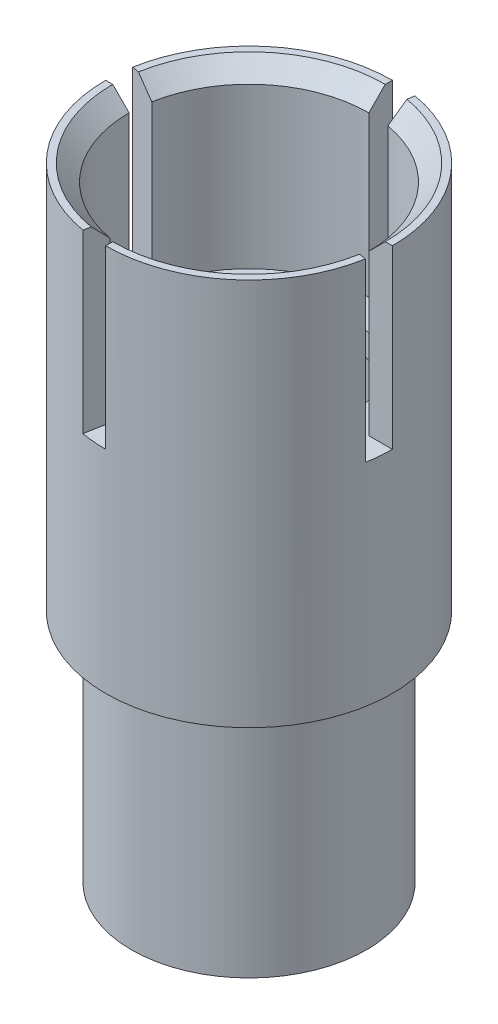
ISO-10303-21;
HEADER;
FILE_DESCRIPTION(('STEP AP214'),'2;1');
FILE_NAME('part.step','',(''),(''),'','','');
FILE_SCHEMA(('AUTOMOTIVE_DESIGN { 1 0 10303 214 1 1 1 1 }'));
ENDSEC;
DATA;
#1=APPLICATION_CONTEXT('core data for automotive mechanical design processes');
#2=APPLICATION_PROTOCOL_DEFINITION('international standard','automotive_design',2000,#1);
#3=PRODUCT_CONTEXT('',#1,'mechanical');
#4=PRODUCT('Part','Part','',(#3));
#5=PRODUCT_RELATED_PRODUCT_CATEGORY('part','',(#4));
#6=PRODUCT_DEFINITION_FORMATION('','',#4);
#7=PRODUCT_DEFINITION_CONTEXT('part definition',#1,'design');
#8=PRODUCT_DEFINITION('design','',#6,#7);
#9=PRODUCT_DEFINITION_SHAPE('','',#8);
#10=(LENGTH_UNIT() NAMED_UNIT(*) SI_UNIT(.MILLI.,.METRE.));
#11=(NAMED_UNIT(*) PLANE_ANGLE_UNIT() SI_UNIT($,.RADIAN.));
#12=(NAMED_UNIT(*) SI_UNIT($,.STERADIAN.) SOLID_ANGLE_UNIT());
#13=UNCERTAINTY_MEASURE_WITH_UNIT(LENGTH_MEASURE(1.E-05),#10,'distance_accuracy_value','');
#14=(GEOMETRIC_REPRESENTATION_CONTEXT(3) GLOBAL_UNCERTAINTY_ASSIGNED_CONTEXT((#13)) GLOBAL_UNIT_ASSIGNED_CONTEXT((#10,
#11,#12)) REPRESENTATION_CONTEXT('',''));
#15=CARTESIAN_POINT('',(0.,0.,0.));
#16=DIRECTION('',(0.,0.,1.));
#17=DIRECTION('',(1.,0.,0.));
#18=AXIS2_PLACEMENT_3D('',#15,#16,#17);
#19=CARTESIAN_POINT('',(0.,25.4,0.));
#20=DIRECTION('',(0.,-1.,0.));
#21=DIRECTION('',(0.,0.,-1.));
#22=AXIS2_PLACEMENT_3D('',#19,#20,#21);
#23=CYLINDRICAL_SURFACE('',#22,10.16);
#24=CARTESIAN_POINT('',(0.,0.,0.));
#25=DIRECTION('',(0.,-1.,0.));
#26=DIRECTION('',(0.,0.,-1.));
#27=AXIS2_PLACEMENT_3D('',#24,#25,#26);
#28=CIRCLE('',#27,10.16);
#29=CARTESIAN_POINT('',(0.,0.,-10.16));
#30=VERTEX_POINT('',#29);
#31=EDGE_CURVE('E204',#30,#30,#28,.T.);
#32=ORIENTED_EDGE('',*,*,#31,.T.);
#33=EDGE_LOOP('',(#32));
#34=FACE_BOUND('',#33,.T.);
#35=CARTESIAN_POINT('',(0.,27.94,0.));
#36=DIRECTION('',(0.,1.,0.));
#37=DIRECTION('',(0.,0.,1.));
#38=AXIS2_PLACEMENT_3D('',#35,#36,#37);
#39=CIRCLE('',#38,10.16);
#40=CARTESIAN_POINT('',(0.,27.94,10.16));
#41=VERTEX_POINT('',#40);
#42=EDGE_CURVE('E404',#41,#41,#39,.T.);
#43=ORIENTED_EDGE('',*,*,#42,.T.);
#44=EDGE_LOOP('',(#43));
#45=FACE_BOUND('',#44,.T.);
#46=ADVANCED_FACE('F37',(#34,#45),#23,.F.);
#47=CARTESIAN_POINT('',(0.,48.26,0.));
#48=DIRECTION('',(0.,1.,0.));
#49=DIRECTION('',(0.,0.,1.));
#50=AXIS2_PLACEMENT_3D('',#47,#48,#49);
#51=CIRCLE('',#50,10.16);
#52=CARTESIAN_POINT('',(0.,48.26,10.16));
#53=VERTEX_POINT('',#52);
#54=EDGE_CURVE('E220',#53,#53,#51,.T.);
#55=ORIENTED_EDGE('',*,*,#54,.T.);
#56=EDGE_LOOP('',(#55));
#57=FACE_BOUND('',#56,.T.);
#58=CARTESIAN_POINT('',(0.,45.72,0.));
#59=DIRECTION('',(0.,1.,0.));
#60=DIRECTION('',(0.,0.,1.));
#61=AXIS2_PLACEMENT_3D('',#58,#59,#60);
#62=CIRCLE('',#61,10.16);
#63=CARTESIAN_POINT('',(0.,45.72,10.16));
#64=VERTEX_POINT('',#63);
#65=EDGE_CURVE('E401',#64,#64,#62,.T.);
#66=ORIENTED_EDGE('',*,*,#65,.F.);
#67=EDGE_LOOP('',(#66));
#68=FACE_BOUND('',#67,.T.);
#69=ADVANCED_FACE('F424',(#57,#68),#23,.F.);
#70=CARTESIAN_POINT('',(0.,67.31,0.));
#71=DIRECTION('',(0.,1.,0.));
#72=DIRECTION('',(0.,0.,1.));
#73=AXIS2_PLACEMENT_3D('',#70,#71,#72);
#74=PLANE('',#73);
#75=CARTESIAN_POINT('',(0.,67.31,0.));
#76=DIRECTION('',(0.,1.,0.));
#77=DIRECTION('',(0.,0.,1.));
#78=AXIS2_PLACEMENT_3D('',#75,#76,#77);
#79=CIRCLE('',#78,14.732);
#80=CARTESIAN_POINT('',(2.55818495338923,67.31,-14.5081878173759));
#81=VERTEX_POINT('',#80);
#82=CARTESIAN_POINT('',(14.732,67.31,1.54309509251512E-13));
#83=VERTEX_POINT('',#82);
#84=EDGE_CURVE('E251',#81,#83,#79,.F.);
#85=ORIENTED_EDGE('',*,*,#84,.T.);
#86=DIRECTION('',(1.,0.,0.));
#87=VECTOR('',#86,1.);
#88=CARTESIAN_POINT('',(0.,67.31,0.));
#89=LINE('',#88,#87);
#90=CARTESIAN_POINT('',(15.494,67.31,1.62291035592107E-13));
#91=VERTEX_POINT('',#90);
#92=EDGE_CURVE('E52',#83,#91,#89,.T.);
#93=ORIENTED_EDGE('',*,*,#92,.T.);
#94=CARTESIAN_POINT('',(0.,67.31,0.));
#95=DIRECTION('',(0.,1.,0.));
#96=DIRECTION('',(0.,0.,1.));
#97=AXIS2_PLACEMENT_3D('',#94,#95,#96);
#98=CIRCLE('',#97,15.494);
#99=CARTESIAN_POINT('',(2.69050486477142,67.31,-15.2586113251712));
#100=VERTEX_POINT('',#99);
#101=EDGE_CURVE('E210',#91,#100,#98,.T.);
#102=ORIENTED_EDGE('',*,*,#101,.T.);
#103=DIRECTION('',(0.173648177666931,0.,-0.984807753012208));
#104=VECTOR('',#103,1.);
#105=CARTESIAN_POINT('',(0.,67.31,0.));
#106=LINE('',#105,#104);
#107=EDGE_CURVE('E257',#81,#100,#106,.T.);
#108=ORIENTED_EDGE('',*,*,#107,.F.);
#109=EDGE_LOOP('',(#85,#93,#102,#108));
#110=FACE_BOUND('',#109,.T.);
#111=ADVANCED_FACE('F254',(#110),#74,.T.);
#112=CARTESIAN_POINT('',(0.,48.26,0.));
#113=DIRECTION('',(0.,1.,0.));
#114=DIRECTION('',(0.,0.,1.));
#115=AXIS2_PLACEMENT_3D('',#112,#113,#114);
#116=CYLINDRICAL_SURFACE('',#115,12.954);
#117=DIRECTION('',(0.,1.,0.));
#118=VECTOR('',#117,1.);
#119=CARTESIAN_POINT('',(12.954,48.26,1.35685947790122E-13));
#120=LINE('',#119,#118);
#121=CARTESIAN_POINT('',(12.954,48.26,1.35685947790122E-13));
#122=VERTEX_POINT('',#121);
#123=CARTESIAN_POINT('',(12.954,65.532,1.35685947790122E-13));
#124=VERTEX_POINT('',#123);
#125=EDGE_CURVE('E184',#122,#124,#120,.T.);
#126=ORIENTED_EDGE('',*,*,#125,.T.);
#127=CARTESIAN_POINT('',(0.,65.532,0.));
#128=DIRECTION('',(0.,1.,0.));
#129=DIRECTION('',(0.,0.,1.));
#130=AXIS2_PLACEMENT_3D('',#127,#128,#129);
#131=CIRCLE('',#130,12.954);
#132=CARTESIAN_POINT('',(2.24943849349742,65.532,-12.7571996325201));
#133=VERTEX_POINT('',#132);
#134=EDGE_CURVE('E228',#124,#133,#131,.T.);
#135=ORIENTED_EDGE('',*,*,#134,.T.);
#136=DIRECTION('',(0.,1.,0.));
#137=VECTOR('',#136,1.);
#138=CARTESIAN_POINT('',(2.24943849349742,48.26,-12.7571996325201));
#139=LINE('',#138,#137);
#140=CARTESIAN_POINT('',(2.24943849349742,48.26,-12.7571996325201));
#141=VERTEX_POINT('',#140);
#142=EDGE_CURVE('E196',#141,#133,#139,.T.);
#143=ORIENTED_EDGE('',*,*,#142,.F.);
#144=CARTESIAN_POINT('',(0.,48.26,0.));
#145=DIRECTION('',(0.,1.,0.));
#146=DIRECTION('',(0.,0.,1.));
#147=AXIS2_PLACEMENT_3D('',#144,#145,#146);
#148=CIRCLE('',#147,12.954);
#149=EDGE_CURVE('E178',#122,#141,#148,.T.);
#150=ORIENTED_EDGE('',*,*,#149,.F.);
#151=EDGE_LOOP('',(#126,#135,#143,#150));
#152=FACE_BOUND('',#151,.T.);
#153=ADVANCED_FACE('F194',(#152),#116,.F.);
#154=CARTESIAN_POINT('',(0.,65.532,0.));
#155=DIRECTION('',(0.,1.,0.));
#156=DIRECTION('',(0.,0.,1.));
#157=AXIS2_PLACEMENT_3D('',#154,#155,#156);
#158=CONICAL_SURFACE('',#157,12.954,0.785398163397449);
#159=ORIENTED_EDGE('',*,*,#134,.F.);
#160=DIRECTION('',(0.707106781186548,0.707106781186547,0.));
#161=VECTOR('',#160,1.);
#162=CARTESIAN_POINT('',(0.,52.578,0.));
#163=LINE('',#162,#161);
#164=EDGE_CURVE('E45',#124,#83,#163,.T.);
#165=ORIENTED_EDGE('',*,*,#164,.T.);
#166=ORIENTED_EDGE('',*,*,#84,.F.);
#167=DIRECTION('',(0.122787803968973,0.707106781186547,-0.69636424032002));
#168=VECTOR('',#167,1.);
#169=CARTESIAN_POINT('',(0.,52.578,0.));
#170=LINE('',#169,#168);
#171=EDGE_CURVE('E245',#133,#81,#170,.T.);
#172=ORIENTED_EDGE('',*,*,#171,.F.);
#173=EDGE_LOOP('',(#159,#165,#166,#172));
#174=FACE_BOUND('',#173,.T.);
#175=ADVANCED_FACE('F249',(#174),#158,.F.);
#176=CARTESIAN_POINT('',(-14.5081878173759,67.31,-2.55818495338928));
#177=VERTEX_POINT('',#176);
#178=CARTESIAN_POINT('',(0.,67.31,-14.732));
#179=VERTEX_POINT('',#178);
#180=EDGE_CURVE('E233',#177,#179,#79,.F.);
#181=ORIENTED_EDGE('',*,*,#180,.T.);
#182=DIRECTION('',(0.,0.,-1.));
#183=VECTOR('',#182,1.);
#184=CARTESIAN_POINT('',(0.,67.31,0.));
#185=LINE('',#184,#183);
#186=CARTESIAN_POINT('',(0.,67.31,-15.494));
#187=VERTEX_POINT('',#186);
#188=EDGE_CURVE('E60',#179,#187,#185,.T.);
#189=ORIENTED_EDGE('',*,*,#188,.T.);
#190=CARTESIAN_POINT('',(-15.2586113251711,67.31,-2.69050486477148));
#191=VERTEX_POINT('',#190);
#192=EDGE_CURVE('E375',#187,#191,#98,.T.);
#193=ORIENTED_EDGE('',*,*,#192,.T.);
#194=DIRECTION('',(-0.984807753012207,0.,-0.173648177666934));
#195=VECTOR('',#194,1.);
#196=CARTESIAN_POINT('',(0.,67.31,0.));
#197=LINE('',#196,#195);
#198=EDGE_CURVE('E358',#177,#191,#197,.T.);
#199=ORIENTED_EDGE('',*,*,#198,.F.);
#200=EDGE_LOOP('',(#181,#189,#193,#199));
#201=FACE_BOUND('',#200,.T.);
#202=ADVANCED_FACE('F475',(#201),#74,.T.);
#203=DIRECTION('',(0.,1.,0.));
#204=VECTOR('',#203,1.);
#205=CARTESIAN_POINT('',(0.,48.26,-12.954));
#206=LINE('',#205,#204);
#207=CARTESIAN_POINT('',(0.,48.26,-12.954));
#208=VERTEX_POINT('',#207);
#209=CARTESIAN_POINT('',(0.,65.532,-12.954));
#210=VERTEX_POINT('',#209);
#211=EDGE_CURVE('E333',#208,#210,#206,.T.);
#212=ORIENTED_EDGE('',*,*,#211,.T.);
#213=CARTESIAN_POINT('',(-12.7571996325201,65.532,-2.24943849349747));
#214=VERTEX_POINT('',#213);
#215=EDGE_CURVE('E321',#210,#214,#131,.T.);
#216=ORIENTED_EDGE('',*,*,#215,.T.);
#217=DIRECTION('',(0.,1.,0.));
#218=VECTOR('',#217,1.);
#219=CARTESIAN_POINT('',(-12.7571996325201,48.26,-2.24943849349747));
#220=LINE('',#219,#218);
#221=CARTESIAN_POINT('',(-12.7571996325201,48.26,-2.24943849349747));
#222=VERTEX_POINT('',#221);
#223=EDGE_CURVE('E351',#222,#214,#220,.T.);
#224=ORIENTED_EDGE('',*,*,#223,.F.);
#225=EDGE_CURVE('E198',#208,#222,#148,.T.);
#226=ORIENTED_EDGE('',*,*,#225,.F.);
#227=EDGE_LOOP('',(#212,#216,#224,#226));
#228=FACE_BOUND('',#227,.T.);
#229=ADVANCED_FACE('F467',(#228),#116,.F.);
#230=ORIENTED_EDGE('',*,*,#215,.F.);
#231=DIRECTION('',(0.,0.707106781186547,-0.707106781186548));
#232=VECTOR('',#231,1.);
#233=CARTESIAN_POINT('',(0.,52.578,0.));
#234=LINE('',#233,#232);
#235=EDGE_CURVE('E243',#210,#179,#234,.T.);
#236=ORIENTED_EDGE('',*,*,#235,.T.);
#237=ORIENTED_EDGE('',*,*,#180,.F.);
#238=DIRECTION('',(-0.696364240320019,0.707106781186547,-0.122787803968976));
#239=VECTOR('',#238,1.);
#240=CARTESIAN_POINT('',(0.,52.578,0.));
#241=LINE('',#240,#239);
#242=EDGE_CURVE('E241',#214,#177,#241,.T.);
#243=ORIENTED_EDGE('',*,*,#242,.F.);
#244=EDGE_LOOP('',(#230,#236,#237,#243));
#245=FACE_BOUND('',#244,.T.);
#246=ADVANCED_FACE('F457',(#245),#158,.F.);
#247=CARTESIAN_POINT('',(-2.55818495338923,67.31,14.5081878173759));
#248=VERTEX_POINT('',#247);
#249=CARTESIAN_POINT('',(-14.732,67.31,0.));
#250=VERTEX_POINT('',#249);
#251=EDGE_CURVE('E229',#248,#250,#79,.F.);
#252=ORIENTED_EDGE('',*,*,#251,.T.);
#253=DIRECTION('',(-1.,0.,0.));
#254=VECTOR('',#253,1.);
#255=CARTESIAN_POINT('',(0.,67.31,0.));
#256=LINE('',#255,#254);
#257=CARTESIAN_POINT('',(-15.494,67.31,0.));
#258=VERTEX_POINT('',#257);
#259=EDGE_CURVE('E353',#250,#258,#256,.T.);
#260=ORIENTED_EDGE('',*,*,#259,.T.);
#261=CARTESIAN_POINT('',(-2.69050486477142,67.31,15.2586113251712));
#262=VERTEX_POINT('',#261);
#263=EDGE_CURVE('E211',#258,#262,#98,.T.);
#264=ORIENTED_EDGE('',*,*,#263,.T.);
#265=DIRECTION('',(-0.173648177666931,0.,0.984807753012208));
#266=VECTOR('',#265,1.);
#267=CARTESIAN_POINT('',(0.,67.31,0.));
#268=LINE('',#267,#266);
#269=EDGE_CURVE('E298',#248,#262,#268,.T.);
#270=ORIENTED_EDGE('',*,*,#269,.F.);
#271=EDGE_LOOP('',(#252,#260,#264,#270));
#272=FACE_BOUND('',#271,.T.);
#273=ADVANCED_FACE('F374',(#272),#74,.T.);
#274=DIRECTION('',(0.,1.,0.));
#275=VECTOR('',#274,1.);
#276=CARTESIAN_POINT('',(-12.954,48.26,0.));
#277=LINE('',#276,#275);
#278=CARTESIAN_POINT('',(-12.954,48.26,0.));
#279=VERTEX_POINT('',#278);
#280=CARTESIAN_POINT('',(-12.954,65.532,0.));
#281=VERTEX_POINT('',#280);
#282=EDGE_CURVE('E319',#279,#281,#277,.T.);
#283=ORIENTED_EDGE('',*,*,#282,.T.);
#284=CARTESIAN_POINT('',(-2.24943849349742,65.532,12.7571996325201));
#285=VERTEX_POINT('',#284);
#286=EDGE_CURVE('E217',#281,#285,#131,.T.);
#287=ORIENTED_EDGE('',*,*,#286,.T.);
#288=DIRECTION('',(0.,1.,0.));
#289=VECTOR('',#288,1.);
#290=CARTESIAN_POINT('',(-2.24943849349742,48.26,12.7571996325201));
#291=LINE('',#290,#289);
#292=CARTESIAN_POINT('',(-2.24943849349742,48.26,12.7571996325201));
#293=VERTEX_POINT('',#292);
#294=EDGE_CURVE('E277',#293,#285,#291,.T.);
#295=ORIENTED_EDGE('',*,*,#294,.F.);
#296=EDGE_CURVE('E201',#279,#293,#148,.T.);
#297=ORIENTED_EDGE('',*,*,#296,.F.);
#298=EDGE_LOOP('',(#283,#287,#295,#297));
#299=FACE_BOUND('',#298,.T.);
#300=ADVANCED_FACE('F316',(#299),#116,.F.);
#301=ORIENTED_EDGE('',*,*,#286,.F.);
#302=DIRECTION('',(-0.707106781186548,0.707106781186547,0.));
#303=VECTOR('',#302,1.);
#304=CARTESIAN_POINT('',(0.,52.578,0.));
#305=LINE('',#304,#303);
#306=EDGE_CURVE('E238',#281,#250,#305,.T.);
#307=ORIENTED_EDGE('',*,*,#306,.T.);
#308=ORIENTED_EDGE('',*,*,#251,.F.);
#309=DIRECTION('',(-0.122787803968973,0.707106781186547,0.69636424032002));
#310=VECTOR('',#309,1.);
#311=CARTESIAN_POINT('',(0.,52.578,0.));
#312=LINE('',#311,#310);
#313=EDGE_CURVE('E236',#285,#248,#312,.T.);
#314=ORIENTED_EDGE('',*,*,#313,.F.);
#315=EDGE_LOOP('',(#301,#307,#308,#314));
#316=FACE_BOUND('',#315,.T.);
#317=ADVANCED_FACE('F371',(#316),#158,.F.);
#318=CARTESIAN_POINT('',(0.,25.4,0.));
#319=DIRECTION('',(0.,-1.,0.));
#320=DIRECTION('',(0.,0.,-1.));
#321=AXIS2_PLACEMENT_3D('',#318,#319,#320);
#322=CYLINDRICAL_SURFACE('',#321,12.7);
#323=CARTESIAN_POINT('',(0.,25.4,0.));
#324=DIRECTION('',(0.,1.,0.));
#325=DIRECTION('',(0.,0.,1.));
#326=AXIS2_PLACEMENT_3D('',#323,#324,#325);
#327=CIRCLE('',#326,12.7);
#328=CARTESIAN_POINT('',(0.,25.4,12.7));
#329=VERTEX_POINT('',#328);
#330=EDGE_CURVE('E214',#329,#329,#327,.T.);
#331=ORIENTED_EDGE('',*,*,#330,.F.);
#332=EDGE_LOOP('',(#331));
#333=FACE_BOUND('',#332,.T.);
#334=CARTESIAN_POINT('',(0.,0.,0.));
#335=DIRECTION('',(0.,1.,0.));
#336=DIRECTION('',(0.,0.,1.));
#337=AXIS2_PLACEMENT_3D('',#334,#335,#336);
#338=CIRCLE('',#337,12.7);
#339=CARTESIAN_POINT('',(0.,0.,12.7));
#340=VERTEX_POINT('',#339);
#341=EDGE_CURVE('E209',#340,#340,#338,.T.);
#342=ORIENTED_EDGE('',*,*,#341,.T.);
#343=EDGE_LOOP('',(#342));
#344=FACE_BOUND('',#343,.T.);
#345=ADVANCED_FACE('F450',(#333,#344),#322,.T.);
#346=CARTESIAN_POINT('',(0.,0.,0.));
#347=DIRECTION('',(0.,1.,0.));
#348=DIRECTION('',(0.,0.,1.));
#349=AXIS2_PLACEMENT_3D('',#346,#347,#348);
#350=PLANE('',#349);
#351=ORIENTED_EDGE('',*,*,#31,.F.);
#352=EDGE_LOOP('',(#351));
#353=FACE_BOUND('',#352,.T.);
#354=ORIENTED_EDGE('',*,*,#341,.F.);
#355=EDGE_LOOP('',(#354));
#356=FACE_BOUND('',#355,.T.);
#357=ADVANCED_FACE('F448',(#353,#356),#350,.F.);
#358=CARTESIAN_POINT('',(0.,67.31,0.));
#359=DIRECTION('',(0.,-1.,0.));
#360=DIRECTION('',(0.,0.,-1.));
#361=AXIS2_PLACEMENT_3D('',#358,#359,#360);
#362=CYLINDRICAL_SURFACE('',#361,15.494);
#363=CARTESIAN_POINT('',(0.,48.26,0.));
#364=DIRECTION('',(0.,-1.,0.));
#365=DIRECTION('',(0.,0.,-1.));
#366=AXIS2_PLACEMENT_3D('',#363,#364,#365);
#367=CIRCLE('',#366,15.494);
#368=CARTESIAN_POINT('',(15.494,48.26,1.62291035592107E-13));
#369=VERTEX_POINT('',#368);
#370=CARTESIAN_POINT('',(15.2586113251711,48.26,2.69050486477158));
#371=VERTEX_POINT('',#370);
#372=EDGE_CURVE('E182',#369,#371,#367,.T.);
#373=ORIENTED_EDGE('',*,*,#372,.T.);
#374=DIRECTION('',(0.,-1.,0.));
#375=VECTOR('',#374,1.);
#376=CARTESIAN_POINT('',(15.2586113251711,67.31,2.69050486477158));
#377=LINE('',#376,#375);
#378=CARTESIAN_POINT('',(15.2586113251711,67.31,2.69050486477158));
#379=VERTEX_POINT('',#378);
#380=EDGE_CURVE('E385',#371,#379,#377,.F.);
#381=ORIENTED_EDGE('',*,*,#380,.T.);
#382=CARTESIAN_POINT('',(0.,67.31,15.494));
#383=VERTEX_POINT('',#382);
#384=EDGE_CURVE('E206',#383,#379,#98,.T.);
#385=ORIENTED_EDGE('',*,*,#384,.F.);
#386=DIRECTION('',(0.,-1.,0.));
#387=VECTOR('',#386,1.);
#388=CARTESIAN_POINT('',(0.,67.31,15.494));
#389=LINE('',#388,#387);
#390=CARTESIAN_POINT('',(0.,48.26,15.494));
#391=VERTEX_POINT('',#390);
#392=EDGE_CURVE('E276',#391,#383,#389,.F.);
#393=ORIENTED_EDGE('',*,*,#392,.F.);
#394=CARTESIAN_POINT('',(0.,48.26,0.));
#395=DIRECTION('',(0.,-1.,0.));
#396=DIRECTION('',(0.,0.,-1.));
#397=AXIS2_PLACEMENT_3D('',#394,#395,#396);
#398=CIRCLE('',#397,15.494);
#399=CARTESIAN_POINT('',(-2.69050486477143,48.26,15.2586113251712));
#400=VERTEX_POINT('',#399);
#401=EDGE_CURVE('E223',#391,#400,#398,.T.);
#402=ORIENTED_EDGE('',*,*,#401,.T.);
#403=DIRECTION('',(0.,-1.,0.));
#404=VECTOR('',#403,1.);
#405=CARTESIAN_POINT('',(-2.69050486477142,67.31,15.2586113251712));
#406=LINE('',#405,#404);
#407=EDGE_CURVE('E301',#400,#262,#406,.F.);
#408=ORIENTED_EDGE('',*,*,#407,.T.);
#409=ORIENTED_EDGE('',*,*,#263,.F.);
#410=DIRECTION('',(0.,-1.,0.));
#411=VECTOR('',#410,1.);
#412=CARTESIAN_POINT('',(-15.494,67.31,0.));
#413=LINE('',#412,#411);
#414=CARTESIAN_POINT('',(-15.494,48.26,0.));
#415=VERTEX_POINT('',#414);
#416=EDGE_CURVE('E356',#415,#258,#413,.F.);
#417=ORIENTED_EDGE('',*,*,#416,.F.);
#418=CARTESIAN_POINT('',(0.,48.26,0.));
#419=DIRECTION('',(0.,-1.,0.));
#420=DIRECTION('',(0.,0.,-1.));
#421=AXIS2_PLACEMENT_3D('',#418,#419,#420);
#422=CIRCLE('',#421,15.494);
#423=CARTESIAN_POINT('',(-15.2586113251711,48.26,-2.69050486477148));
#424=VERTEX_POINT('',#423);
#425=EDGE_CURVE('E291',#415,#424,#422,.T.);
#426=ORIENTED_EDGE('',*,*,#425,.T.);
#427=DIRECTION('',(0.,-1.,0.));
#428=VECTOR('',#427,1.);
#429=CARTESIAN_POINT('',(-15.2586113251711,67.31,-2.69050486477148));
#430=LINE('',#429,#428);
#431=EDGE_CURVE('E361',#424,#191,#430,.F.);
#432=ORIENTED_EDGE('',*,*,#431,.T.);
#433=ORIENTED_EDGE('',*,*,#192,.F.);
#434=DIRECTION('',(0.,-1.,0.));
#435=VECTOR('',#434,1.);
#436=CARTESIAN_POINT('',(0.,67.31,-15.494));
#437=LINE('',#436,#435);
#438=CARTESIAN_POINT('',(0.,48.26,-15.494));
#439=VERTEX_POINT('',#438);
#440=EDGE_CURVE('E331',#439,#187,#437,.F.);
#441=ORIENTED_EDGE('',*,*,#440,.F.);
#442=CARTESIAN_POINT('',(0.,48.26,0.));
#443=DIRECTION('',(0.,-1.,0.));
#444=DIRECTION('',(0.,0.,-1.));
#445=AXIS2_PLACEMENT_3D('',#442,#443,#444);
#446=CIRCLE('',#445,15.494);
#447=CARTESIAN_POINT('',(2.69050486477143,48.26,-15.2586113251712));
#448=VERTEX_POINT('',#447);
#449=EDGE_CURVE('E342',#439,#448,#446,.T.);
#450=ORIENTED_EDGE('',*,*,#449,.T.);
#451=DIRECTION('',(0.,-1.,0.));
#452=VECTOR('',#451,1.);
#453=CARTESIAN_POINT('',(2.69050486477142,67.31,-15.2586113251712));
#454=LINE('',#453,#452);
#455=EDGE_CURVE('E339',#448,#100,#454,.F.);
#456=ORIENTED_EDGE('',*,*,#455,.T.);
#457=ORIENTED_EDGE('',*,*,#101,.F.);
#458=DIRECTION('',(0.,-1.,0.));
#459=VECTOR('',#458,1.);
#460=CARTESIAN_POINT('',(15.494,67.31,1.62291035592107E-13));
#461=LINE('',#460,#459);
#462=EDGE_CURVE('E391',#369,#91,#461,.F.);
#463=ORIENTED_EDGE('',*,*,#462,.F.);
#464=EDGE_LOOP('',(#373,#381,#385,#393,#402,#408,#409,#417,#426,#432,#433,#441,#450,#456,#457,#463));
#465=FACE_BOUND('',#464,.T.);
#466=CARTESIAN_POINT('',(0.,25.4,0.));
#467=DIRECTION('',(0.,1.,0.));
#468=DIRECTION('',(0.,0.,1.));
#469=AXIS2_PLACEMENT_3D('',#466,#467,#468);
#470=CIRCLE('',#469,15.494);
#471=CARTESIAN_POINT('',(0.,25.4,15.494));
#472=VERTEX_POINT('',#471);
#473=EDGE_CURVE('E200',#472,#472,#470,.T.);
#474=ORIENTED_EDGE('',*,*,#473,.T.);
#475=EDGE_LOOP('',(#474));
#476=FACE_BOUND('',#475,.T.);
#477=ADVANCED_FACE('F305',(#465,#476),#362,.T.);
#478=DIRECTION('',(0.984807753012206,0.,0.173648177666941));
#479=VECTOR('',#478,1.);
#480=CARTESIAN_POINT('',(0.,67.31,0.));
#481=LINE('',#480,#479);
#482=CARTESIAN_POINT('',(14.5081878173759,67.31,2.55818495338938));
#483=VERTEX_POINT('',#482);
#484=EDGE_CURVE('E267',#483,#379,#481,.T.);
#485=ORIENTED_EDGE('',*,*,#484,.F.);
#486=CARTESIAN_POINT('',(0.,67.31,14.732));
#487=VERTEX_POINT('',#486);
#488=EDGE_CURVE('E227',#483,#487,#79,.F.);
#489=ORIENTED_EDGE('',*,*,#488,.T.);
#490=DIRECTION('',(0.,0.,1.));
#491=VECTOR('',#490,1.);
#492=CARTESIAN_POINT('',(0.,67.31,0.));
#493=LINE('',#492,#491);
#494=EDGE_CURVE('E265',#487,#383,#493,.T.);
#495=ORIENTED_EDGE('',*,*,#494,.T.);
#496=ORIENTED_EDGE('',*,*,#384,.T.);
#497=EDGE_LOOP('',(#485,#489,#495,#496));
#498=FACE_BOUND('',#497,.T.);
#499=ADVANCED_FACE('F264',(#498),#74,.T.);
#500=CARTESIAN_POINT('',(0.,25.4,0.));
#501=DIRECTION('',(0.,1.,0.));
#502=DIRECTION('',(0.,0.,1.));
#503=AXIS2_PLACEMENT_3D('',#500,#501,#502);
#504=PLANE('',#503);
#505=ORIENTED_EDGE('',*,*,#330,.T.);
#506=EDGE_LOOP('',(#505));
#507=FACE_BOUND('',#506,.T.);
#508=ORIENTED_EDGE('',*,*,#473,.F.);
#509=EDGE_LOOP('',(#508));
#510=FACE_BOUND('',#509,.T.);
#511=ADVANCED_FACE('F440',(#507,#510),#504,.F.);
#512=CARTESIAN_POINT('',(0.,65.532,12.954));
#513=VERTEX_POINT('',#512);
#514=CARTESIAN_POINT('',(12.7571996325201,65.532,2.24943849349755));
#515=VERTEX_POINT('',#514);
#516=EDGE_CURVE('E224',#513,#515,#131,.T.);
#517=ORIENTED_EDGE('',*,*,#516,.T.);
#518=DIRECTION('',(0.,1.,0.));
#519=VECTOR('',#518,1.);
#520=CARTESIAN_POINT('',(12.7571996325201,48.26,2.24943849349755));
#521=LINE('',#520,#519);
#522=CARTESIAN_POINT('',(12.7571996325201,48.26,2.24943849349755));
#523=VERTEX_POINT('',#522);
#524=EDGE_CURVE('E284',#523,#515,#521,.T.);
#525=ORIENTED_EDGE('',*,*,#524,.F.);
#526=CARTESIAN_POINT('',(0.,48.26,12.954));
#527=VERTEX_POINT('',#526);
#528=EDGE_CURVE('E197',#527,#523,#148,.T.);
#529=ORIENTED_EDGE('',*,*,#528,.F.);
#530=DIRECTION('',(0.,1.,0.));
#531=VECTOR('',#530,1.);
#532=CARTESIAN_POINT('',(0.,48.26,12.954));
#533=LINE('',#532,#531);
#534=EDGE_CURVE('E285',#527,#513,#533,.T.);
#535=ORIENTED_EDGE('',*,*,#534,.T.);
#536=EDGE_LOOP('',(#517,#525,#529,#535));
#537=FACE_BOUND('',#536,.T.);
#538=ADVANCED_FACE('F282',(#537),#116,.F.);
#539=CARTESIAN_POINT('',(0.,48.26,0.));
#540=DIRECTION('',(0.,1.,0.));
#541=DIRECTION('',(0.,0.,1.));
#542=AXIS2_PLACEMENT_3D('',#539,#540,#541);
#543=PLANE('',#542);
#544=ORIENTED_EDGE('',*,*,#54,.F.);
#545=EDGE_LOOP('',(#544));
#546=FACE_BOUND('',#545,.T.);
#547=ORIENTED_EDGE('',*,*,#528,.T.);
#548=DIRECTION('',(-0.984807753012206,0.,-0.173648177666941));
#549=VECTOR('',#548,1.);
#550=CARTESIAN_POINT('',(12.7571996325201,48.26,2.24943849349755));
#551=LINE('',#550,#549);
#552=EDGE_CURVE('E191',#371,#523,#551,.T.);
#553=ORIENTED_EDGE('',*,*,#552,.F.);
#554=ORIENTED_EDGE('',*,*,#372,.F.);
#555=DIRECTION('',(-1.,0.,0.));
#556=VECTOR('',#555,1.);
#557=CARTESIAN_POINT('',(12.954,48.26,1.35685947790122E-13));
#558=LINE('',#557,#556);
#559=EDGE_CURVE('E172',#369,#122,#558,.T.);
#560=ORIENTED_EDGE('',*,*,#559,.T.);
#561=ORIENTED_EDGE('',*,*,#149,.T.);
#562=DIRECTION('',(-0.173648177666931,0.,0.984807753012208));
#563=VECTOR('',#562,1.);
#564=CARTESIAN_POINT('',(2.24943849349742,48.26,-12.7571996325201));
#565=LINE('',#564,#563);
#566=EDGE_CURVE('E329',#448,#141,#565,.T.);
#567=ORIENTED_EDGE('',*,*,#566,.F.);
#568=ORIENTED_EDGE('',*,*,#449,.F.);
#569=DIRECTION('',(0.,0.,1.));
#570=VECTOR('',#569,1.);
#571=CARTESIAN_POINT('',(0.,48.26,-12.954));
#572=LINE('',#571,#570);
#573=EDGE_CURVE('E380',#439,#208,#572,.T.);
#574=ORIENTED_EDGE('',*,*,#573,.T.);
#575=ORIENTED_EDGE('',*,*,#225,.T.);
#576=DIRECTION('',(0.984807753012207,0.,0.173648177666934));
#577=VECTOR('',#576,1.);
#578=CARTESIAN_POINT('',(-12.7571996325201,48.26,-2.24943849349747));
#579=LINE('',#578,#577);
#580=EDGE_CURVE('E348',#424,#222,#579,.T.);
#581=ORIENTED_EDGE('',*,*,#580,.F.);
#582=ORIENTED_EDGE('',*,*,#425,.F.);
#583=DIRECTION('',(1.,0.,0.));
#584=VECTOR('',#583,1.);
#585=CARTESIAN_POINT('',(-12.954,48.26,0.));
#586=LINE('',#585,#584);
#587=EDGE_CURVE('E345',#415,#279,#586,.T.);
#588=ORIENTED_EDGE('',*,*,#587,.T.);
#589=ORIENTED_EDGE('',*,*,#296,.T.);
#590=DIRECTION('',(0.173648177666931,0.,-0.984807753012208));
#591=VECTOR('',#590,1.);
#592=CARTESIAN_POINT('',(-2.24943849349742,48.26,12.7571996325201));
#593=LINE('',#592,#591);
#594=EDGE_CURVE('E286',#400,#293,#593,.T.);
#595=ORIENTED_EDGE('',*,*,#594,.F.);
#596=ORIENTED_EDGE('',*,*,#401,.F.);
#597=DIRECTION('',(0.,0.,-1.));
#598=VECTOR('',#597,1.);
#599=CARTESIAN_POINT('',(0.,48.26,12.954));
#600=LINE('',#599,#598);
#601=EDGE_CURVE('E287',#391,#527,#600,.T.);
#602=ORIENTED_EDGE('',*,*,#601,.T.);
#603=EDGE_LOOP('',(#547,#553,#554,#560,#561,#567,#568,#574,#575,#581,#582,#588,#589,#595,#596,#602));
#604=FACE_BOUND('',#603,.T.);
#605=ADVANCED_FACE('F175',(#546,#604),#543,.T.);
#606=DIRECTION('',(0.696364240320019,0.707106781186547,0.122787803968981));
#607=VECTOR('',#606,1.);
#608=CARTESIAN_POINT('',(0.,52.578,0.));
#609=LINE('',#608,#607);
#610=EDGE_CURVE('E11',#515,#483,#609,.T.);
#611=ORIENTED_EDGE('',*,*,#610,.F.);
#612=ORIENTED_EDGE('',*,*,#516,.F.);
#613=DIRECTION('',(0.,0.707106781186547,0.707106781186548));
#614=VECTOR('',#613,1.);
#615=CARTESIAN_POINT('',(0.,52.578,0.));
#616=LINE('',#615,#614);
#617=EDGE_CURVE('E232',#513,#487,#616,.T.);
#618=ORIENTED_EDGE('',*,*,#617,.T.);
#619=ORIENTED_EDGE('',*,*,#488,.F.);
#620=EDGE_LOOP('',(#611,#612,#618,#619));
#621=FACE_BOUND('',#620,.T.);
#622=ADVANCED_FACE('F39',(#621),#158,.F.);
#623=CARTESIAN_POINT('',(0.,0.,0.));
#624=DIRECTION('',(-0.984807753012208,0.,-0.173648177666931));
#625=DIRECTION('',(-0.173648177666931,0.,0.984807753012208));
#626=AXIS2_PLACEMENT_3D('',#623,#624,#625);
#627=PLANE('',#626);
#628=ORIENTED_EDGE('',*,*,#594,.T.);
#629=ORIENTED_EDGE('',*,*,#294,.T.);
#630=ORIENTED_EDGE('',*,*,#313,.T.);
#631=ORIENTED_EDGE('',*,*,#269,.T.);
#632=ORIENTED_EDGE('',*,*,#407,.F.);
#633=EDGE_LOOP('',(#628,#629,#630,#631,#632));
#634=FACE_BOUND('',#633,.T.);
#635=ADVANCED_FACE('F312',(#634),#627,.F.);
#636=CARTESIAN_POINT('',(0.,0.,0.));
#637=DIRECTION('',(-1.,0.,0.));
#638=DIRECTION('',(0.,0.,1.));
#639=AXIS2_PLACEMENT_3D('',#636,#637,#638);
#640=PLANE('',#639);
#641=ORIENTED_EDGE('',*,*,#392,.T.);
#642=ORIENTED_EDGE('',*,*,#494,.F.);
#643=ORIENTED_EDGE('',*,*,#617,.F.);
#644=ORIENTED_EDGE('',*,*,#534,.F.);
#645=ORIENTED_EDGE('',*,*,#601,.F.);
#646=EDGE_LOOP('',(#641,#642,#643,#644,#645));
#647=FACE_BOUND('',#646,.T.);
#648=ADVANCED_FACE('F271',(#647),#640,.T.);
#649=CARTESIAN_POINT('',(0.,0.,0.));
#650=DIRECTION('',(0.173648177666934,0.,-0.984807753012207));
#651=DIRECTION('',(-0.984807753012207,0.,-0.173648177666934));
#652=AXIS2_PLACEMENT_3D('',#649,#650,#651);
#653=PLANE('',#652);
#654=ORIENTED_EDGE('',*,*,#580,.T.);
#655=ORIENTED_EDGE('',*,*,#223,.T.);
#656=ORIENTED_EDGE('',*,*,#242,.T.);
#657=ORIENTED_EDGE('',*,*,#198,.T.);
#658=ORIENTED_EDGE('',*,*,#431,.F.);
#659=EDGE_LOOP('',(#654,#655,#656,#657,#658));
#660=FACE_BOUND('',#659,.T.);
#661=ADVANCED_FACE('F564',(#660),#653,.F.);
#662=CARTESIAN_POINT('',(0.,0.,0.));
#663=DIRECTION('',(0.,0.,-1.));
#664=DIRECTION('',(-1.,0.,0.));
#665=AXIS2_PLACEMENT_3D('',#662,#663,#664);
#666=PLANE('',#665);
#667=ORIENTED_EDGE('',*,*,#416,.T.);
#668=ORIENTED_EDGE('',*,*,#259,.F.);
#669=ORIENTED_EDGE('',*,*,#306,.F.);
#670=ORIENTED_EDGE('',*,*,#282,.F.);
#671=ORIENTED_EDGE('',*,*,#587,.F.);
#672=EDGE_LOOP('',(#667,#668,#669,#670,#671));
#673=FACE_BOUND('',#672,.T.);
#674=ADVANCED_FACE('F369',(#673),#666,.T.);
#675=CARTESIAN_POINT('',(0.,0.,0.));
#676=DIRECTION('',(0.984807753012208,0.,0.173648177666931));
#677=DIRECTION('',(0.173648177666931,0.,-0.984807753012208));
#678=AXIS2_PLACEMENT_3D('',#675,#676,#677);
#679=PLANE('',#678);
#680=ORIENTED_EDGE('',*,*,#566,.T.);
#681=ORIENTED_EDGE('',*,*,#142,.T.);
#682=ORIENTED_EDGE('',*,*,#171,.T.);
#683=ORIENTED_EDGE('',*,*,#107,.T.);
#684=ORIENTED_EDGE('',*,*,#455,.F.);
#685=EDGE_LOOP('',(#680,#681,#682,#683,#684));
#686=FACE_BOUND('',#685,.T.);
#687=ADVANCED_FACE('F328',(#686),#679,.F.);
#688=CARTESIAN_POINT('',(0.,0.,0.));
#689=DIRECTION('',(1.,0.,0.));
#690=DIRECTION('',(0.,0.,-1.));
#691=AXIS2_PLACEMENT_3D('',#688,#689,#690);
#692=PLANE('',#691);
#693=ORIENTED_EDGE('',*,*,#440,.T.);
#694=ORIENTED_EDGE('',*,*,#188,.F.);
#695=ORIENTED_EDGE('',*,*,#235,.F.);
#696=ORIENTED_EDGE('',*,*,#211,.F.);
#697=ORIENTED_EDGE('',*,*,#573,.F.);
#698=EDGE_LOOP('',(#693,#694,#695,#696,#697));
#699=FACE_BOUND('',#698,.T.);
#700=ADVANCED_FACE('F382',(#699),#692,.T.);
#701=CARTESIAN_POINT('',(0.,0.,0.));
#702=DIRECTION('',(-0.173648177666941,0.,0.984807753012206));
#703=DIRECTION('',(0.984807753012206,0.,0.173648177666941));
#704=AXIS2_PLACEMENT_3D('',#701,#702,#703);
#705=PLANE('',#704);
#706=ORIENTED_EDGE('',*,*,#552,.T.);
#707=ORIENTED_EDGE('',*,*,#524,.T.);
#708=ORIENTED_EDGE('',*,*,#610,.T.);
#709=ORIENTED_EDGE('',*,*,#484,.T.);
#710=ORIENTED_EDGE('',*,*,#380,.F.);
#711=EDGE_LOOP('',(#706,#707,#708,#709,#710));
#712=FACE_BOUND('',#711,.T.);
#713=ADVANCED_FACE('F421',(#712),#705,.F.);
#714=CARTESIAN_POINT('',(0.,0.,0.));
#715=DIRECTION('',(0.,0.,1.));
#716=DIRECTION('',(1.,0.,0.));
#717=AXIS2_PLACEMENT_3D('',#714,#715,#716);
#718=PLANE('',#717);
#719=ORIENTED_EDGE('',*,*,#462,.T.);
#720=ORIENTED_EDGE('',*,*,#92,.F.);
#721=ORIENTED_EDGE('',*,*,#164,.F.);
#722=ORIENTED_EDGE('',*,*,#125,.F.);
#723=ORIENTED_EDGE('',*,*,#559,.F.);
#724=EDGE_LOOP('',(#719,#720,#721,#722,#723));
#725=FACE_BOUND('',#724,.T.);
#726=ADVANCED_FACE('F188',(#725),#718,.T.);
#727=CARTESIAN_POINT('',(0.,27.94,-10.16));
#728=DIRECTION('',(0.,1.,0.));
#729=DIRECTION('',(0.,0.,1.));
#730=AXIS2_PLACEMENT_3D('',#727,#728,#729);
#731=PLANE('',#730);
#732=CARTESIAN_POINT('',(0.,27.94,0.));
#733=DIRECTION('',(0.,1.,0.));
#734=DIRECTION('',(0.,0.,1.));
#735=AXIS2_PLACEMENT_3D('',#732,#733,#734);
#736=CIRCLE('',#735,12.7);
#737=CARTESIAN_POINT('',(0.,27.94,12.7));
#738=VERTEX_POINT('',#737);
#739=EDGE_CURVE('E185',#738,#738,#736,.T.);
#740=ORIENTED_EDGE('',*,*,#739,.T.);
#741=EDGE_LOOP('',(#740));
#742=FACE_BOUND('',#741,.T.);
#743=ORIENTED_EDGE('',*,*,#42,.F.);
#744=EDGE_LOOP('',(#743));
#745=FACE_BOUND('',#744,.T.);
#746=ADVANCED_FACE('F409',(#742,#745),#731,.T.);
#747=CARTESIAN_POINT('',(0.,48.26,0.));
#748=DIRECTION('',(0.,1.,0.));
#749=DIRECTION('',(0.,0.,1.));
#750=AXIS2_PLACEMENT_3D('',#747,#748,#749);
#751=CYLINDRICAL_SURFACE('',#750,12.7);
#752=CARTESIAN_POINT('',(0.,45.72,0.));
#753=DIRECTION('',(0.,1.,0.));
#754=DIRECTION('',(0.,0.,1.));
#755=AXIS2_PLACEMENT_3D('',#752,#753,#754);
#756=CIRCLE('',#755,12.7);
#757=CARTESIAN_POINT('',(0.,45.72,12.7));
#758=VERTEX_POINT('',#757);
#759=EDGE_CURVE('E398',#758,#758,#756,.T.);
#760=ORIENTED_EDGE('',*,*,#759,.T.);
#761=EDGE_LOOP('',(#760));
#762=FACE_BOUND('',#761,.T.);
#763=ORIENTED_EDGE('',*,*,#739,.F.);
#764=EDGE_LOOP('',(#763));
#765=FACE_BOUND('',#764,.T.);
#766=ADVANCED_FACE('F411',(#762,#765),#751,.F.);
#767=CARTESIAN_POINT('',(0.,45.72,-10.16));
#768=DIRECTION('',(0.,-1.,0.));
#769=DIRECTION('',(0.,0.,-1.));
#770=AXIS2_PLACEMENT_3D('',#767,#768,#769);
#771=PLANE('',#770);
#772=ORIENTED_EDGE('',*,*,#65,.T.);
#773=EDGE_LOOP('',(#772));
#774=FACE_BOUND('',#773,.T.);
#775=ORIENTED_EDGE('',*,*,#759,.F.);
#776=EDGE_LOOP('',(#775));
#777=FACE_BOUND('',#776,.T.);
#778=ADVANCED_FACE('F418',(#774,#777),#771,.T.);
#779=CLOSED_SHELL('',(#46,#69,#111,#153,#175,#202,#229,#246,#273,#300,#317,#345,#357,#477,#499,
#511,#538,#605,#622,#635,#648,#661,#674,#687,#700,#713,#726,#746,#766,#778));
#780=MANIFOLD_SOLID_BREP('B2',#779);
#781=ADVANCED_BREP_SHAPE_REPRESENTATION('',(#18,#780),#14);
#782=SHAPE_DEFINITION_REPRESENTATION(#9,#781);
ENDSEC;
END-ISO-10303-21;
